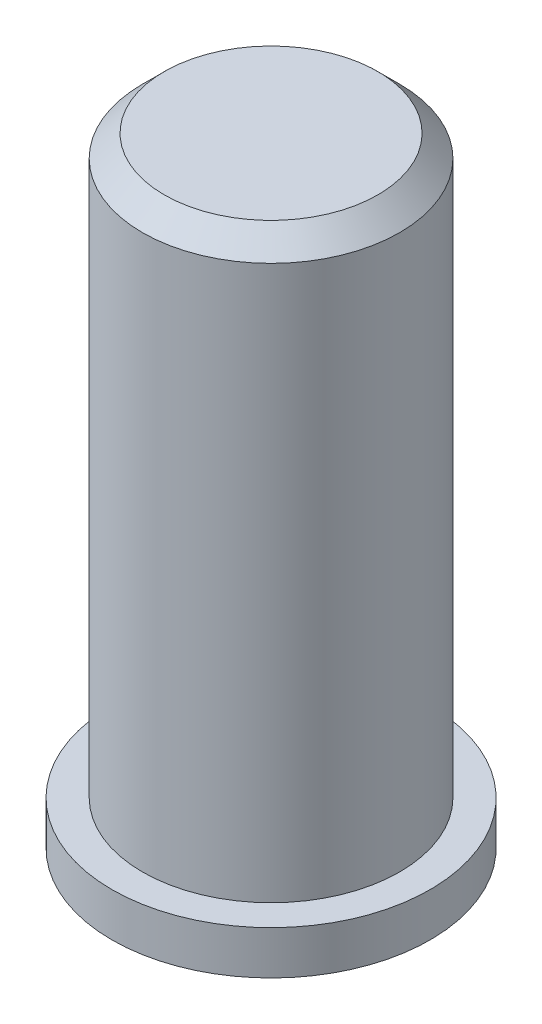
from build123d import *


with BuildPart() as part:
    # Schizzo1 → Rivoluzione1 (revolve)
    with BuildSketch(Plane.XY, mode=Mode.PRIVATE) as rivoluzione1_sk:
        Polygon((0, 0), (0, -0.5), (0.4, -0.5), (0.4, 0), (3.65, 0), (3.65, 1), (2.95, 1), (2.95, 13.7), (2.45, 14.2), (0, 14.2), align=None)
    revolve(rivoluzione1_sk.sketch.rotate(Axis((0, 14.2, 0), (0, -1, 0)), 90), axis=Axis((0, 14.2, 0), (0, -1, 0)))


solid = part.part
